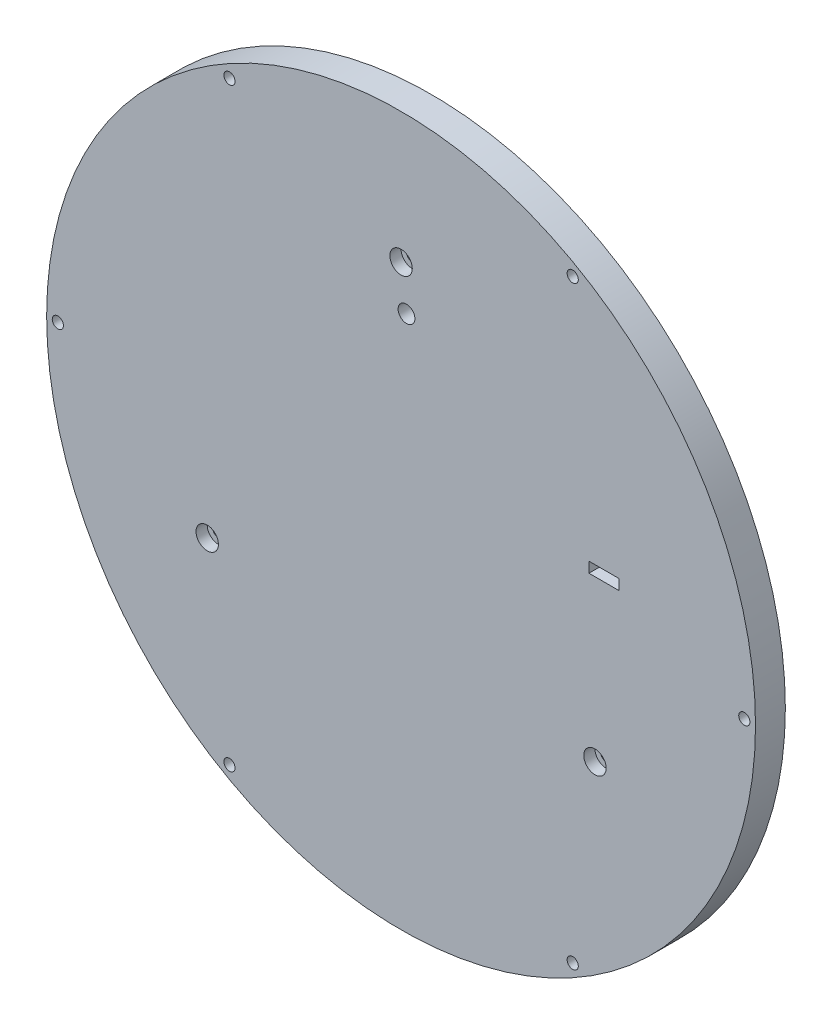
ISO-10303-21;
HEADER;
FILE_DESCRIPTION(('STEP AP214'),'2;1');
FILE_NAME('part.step','',(''),(''),'','','');
FILE_SCHEMA(('AUTOMOTIVE_DESIGN { 1 0 10303 214 1 1 1 1 }'));
ENDSEC;
DATA;
#1=APPLICATION_CONTEXT('core data for automotive mechanical design processes');
#2=APPLICATION_PROTOCOL_DEFINITION('international standard','automotive_design',2000,#1);
#3=PRODUCT_CONTEXT('',#1,'mechanical');
#4=PRODUCT('Part','Part','',(#3));
#5=PRODUCT_RELATED_PRODUCT_CATEGORY('part','',(#4));
#6=PRODUCT_DEFINITION_FORMATION('','',#4);
#7=PRODUCT_DEFINITION_CONTEXT('part definition',#1,'design');
#8=PRODUCT_DEFINITION('design','',#6,#7);
#9=PRODUCT_DEFINITION_SHAPE('','',#8);
#10=(LENGTH_UNIT() NAMED_UNIT(*) SI_UNIT(.MILLI.,.METRE.));
#11=(NAMED_UNIT(*) PLANE_ANGLE_UNIT() SI_UNIT($,.RADIAN.));
#12=(NAMED_UNIT(*) SI_UNIT($,.STERADIAN.) SOLID_ANGLE_UNIT());
#13=UNCERTAINTY_MEASURE_WITH_UNIT(LENGTH_MEASURE(1.E-05),#10,'distance_accuracy_value','');
#14=(GEOMETRIC_REPRESENTATION_CONTEXT(3) GLOBAL_UNCERTAINTY_ASSIGNED_CONTEXT((#13)) GLOBAL_UNIT_ASSIGNED_CONTEXT((#10,
#11,#12)) REPRESENTATION_CONTEXT('',''));
#15=CARTESIAN_POINT('',(0.,0.,0.));
#16=DIRECTION('',(0.,0.,1.));
#17=DIRECTION('',(1.,0.,0.));
#18=AXIS2_PLACEMENT_3D('',#15,#16,#17);
#19=CARTESIAN_POINT('',(-51.9615242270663,-30.,-6.));
#20=DIRECTION('',(0.,0.,1.));
#21=DIRECTION('',(1.,0.,0.));
#22=AXIS2_PLACEMENT_3D('',#19,#20,#21);
#23=CYLINDRICAL_SURFACE('',#22,1.5);
#24=CARTESIAN_POINT('',(-51.9615242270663,-30.,-4.));
#25=DIRECTION('',(0.,0.,1.));
#26=DIRECTION('',(1.,0.,0.));
#27=AXIS2_PLACEMENT_3D('',#24,#25,#26);
#28=CIRCLE('',#27,1.5);
#29=CARTESIAN_POINT('',(-50.4615242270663,-30.,-4.));
#30=VERTEX_POINT('',#29);
#31=EDGE_CURVE('E97',#30,#30,#28,.T.);
#32=ORIENTED_EDGE('',*,*,#31,.F.);
#33=EDGE_LOOP('',(#32));
#34=FACE_BOUND('',#33,.T.);
#35=CARTESIAN_POINT('',(-51.9615242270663,-30.,1.));
#36=DIRECTION('',(0.,0.,1.));
#37=DIRECTION('',(1.,0.,0.));
#38=AXIS2_PLACEMENT_3D('',#35,#36,#37);
#39=CIRCLE('',#38,1.5);
#40=CARTESIAN_POINT('',(-50.4615242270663,-30.,1.));
#41=VERTEX_POINT('',#40);
#42=EDGE_CURVE('E89',#41,#41,#39,.F.);
#43=ORIENTED_EDGE('',*,*,#42,.F.);
#44=EDGE_LOOP('',(#43));
#45=FACE_BOUND('',#44,.T.);
#46=ADVANCED_FACE('F16',(#34,#45),#23,.F.);
#47=CARTESIAN_POINT('',(51.9615242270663,-30.,-6.));
#48=DIRECTION('',(0.,0.,1.));
#49=DIRECTION('',(1.,0.,0.));
#50=AXIS2_PLACEMENT_3D('',#47,#48,#49);
#51=CYLINDRICAL_SURFACE('',#50,1.5);
#52=CARTESIAN_POINT('',(51.9615242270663,-30.,-4.));
#53=DIRECTION('',(0.,0.,1.));
#54=DIRECTION('',(1.,0.,0.));
#55=AXIS2_PLACEMENT_3D('',#52,#53,#54);
#56=CIRCLE('',#55,1.5);
#57=CARTESIAN_POINT('',(53.4615242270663,-30.,-4.));
#58=VERTEX_POINT('',#57);
#59=EDGE_CURVE('E105',#58,#58,#56,.T.);
#60=ORIENTED_EDGE('',*,*,#59,.F.);
#61=EDGE_LOOP('',(#60));
#62=FACE_BOUND('',#61,.T.);
#63=CARTESIAN_POINT('',(51.9615242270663,-30.,1.));
#64=DIRECTION('',(0.,0.,1.));
#65=DIRECTION('',(1.,0.,0.));
#66=AXIS2_PLACEMENT_3D('',#63,#64,#65);
#67=CIRCLE('',#66,1.5);
#68=CARTESIAN_POINT('',(53.4615242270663,-30.,1.));
#69=VERTEX_POINT('',#68);
#70=EDGE_CURVE('E116',#69,#69,#67,.F.);
#71=ORIENTED_EDGE('',*,*,#70,.F.);
#72=EDGE_LOOP('',(#71));
#73=FACE_BOUND('',#72,.T.);
#74=ADVANCED_FACE('F224',(#62,#73),#51,.F.);
#75=CARTESIAN_POINT('',(0.,60.,-6.));
#76=DIRECTION('',(0.,0.,1.));
#77=DIRECTION('',(1.,0.,0.));
#78=AXIS2_PLACEMENT_3D('',#75,#76,#77);
#79=CYLINDRICAL_SURFACE('',#78,1.49999999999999);
#80=CARTESIAN_POINT('',(0.,60.,-4.));
#81=DIRECTION('',(0.,0.,1.));
#82=DIRECTION('',(1.,0.,0.));
#83=AXIS2_PLACEMENT_3D('',#80,#81,#82);
#84=CIRCLE('',#83,1.49999999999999);
#85=CARTESIAN_POINT('',(1.49999999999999,60.,-4.));
#86=VERTEX_POINT('',#85);
#87=EDGE_CURVE('E98',#86,#86,#84,.T.);
#88=ORIENTED_EDGE('',*,*,#87,.F.);
#89=EDGE_LOOP('',(#88));
#90=FACE_BOUND('',#89,.T.);
#91=CARTESIAN_POINT('',(0.,60.,1.));
#92=DIRECTION('',(0.,0.,1.));
#93=DIRECTION('',(1.,0.,0.));
#94=AXIS2_PLACEMENT_3D('',#91,#92,#93);
#95=CIRCLE('',#94,1.49999999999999);
#96=CARTESIAN_POINT('',(1.49999999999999,60.,1.));
#97=VERTEX_POINT('',#96);
#98=EDGE_CURVE('E114',#97,#97,#95,.F.);
#99=ORIENTED_EDGE('',*,*,#98,.F.);
#100=EDGE_LOOP('',(#99));
#101=FACE_BOUND('',#100,.T.);
#102=ADVANCED_FACE('F189',(#90,#101),#79,.F.);
#103=CARTESIAN_POINT('',(0.,0.,4.));
#104=DIRECTION('',(0.,0.,1.));
#105=DIRECTION('',(1.,0.,0.));
#106=AXIS2_PLACEMENT_3D('',#103,#104,#105);
#107=PLANE('',#106);
#108=CARTESIAN_POINT('',(46.,-79.6743371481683,4.));
#109=DIRECTION('',(0.,0.,1.));
#110=DIRECTION('',(1.,0.,0.));
#111=AXIS2_PLACEMENT_3D('',#108,#109,#110);
#112=CIRCLE('',#111,1.5);
#113=CARTESIAN_POINT('',(47.5,-79.6743371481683,4.));
#114=VERTEX_POINT('',#113);
#115=EDGE_CURVE('E138',#114,#114,#112,.T.);
#116=ORIENTED_EDGE('',*,*,#115,.F.);
#117=EDGE_LOOP('',(#116));
#118=FACE_BOUND('',#117,.T.);
#119=CARTESIAN_POINT('',(-46.,-79.6743371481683,4.));
#120=DIRECTION('',(0.,0.,1.));
#121=DIRECTION('',(1.,0.,0.));
#122=AXIS2_PLACEMENT_3D('',#119,#120,#121);
#123=CIRCLE('',#122,1.5);
#124=CARTESIAN_POINT('',(-44.5,-79.6743371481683,4.));
#125=VERTEX_POINT('',#124);
#126=EDGE_CURVE('E140',#125,#125,#123,.T.);
#127=ORIENTED_EDGE('',*,*,#126,.F.);
#128=EDGE_LOOP('',(#127));
#129=FACE_BOUND('',#128,.T.);
#130=CARTESIAN_POINT('',(-92.,0.,4.));
#131=DIRECTION('',(0.,0.,1.));
#132=DIRECTION('',(1.,0.,0.));
#133=AXIS2_PLACEMENT_3D('',#130,#131,#132);
#134=CIRCLE('',#133,1.5);
#135=CARTESIAN_POINT('',(-90.5,0.,4.));
#136=VERTEX_POINT('',#135);
#137=EDGE_CURVE('E133',#136,#136,#134,.T.);
#138=ORIENTED_EDGE('',*,*,#137,.F.);
#139=EDGE_LOOP('',(#138));
#140=FACE_BOUND('',#139,.T.);
#141=CARTESIAN_POINT('',(-46.,79.6743371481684,4.));
#142=DIRECTION('',(0.,0.,1.));
#143=DIRECTION('',(1.,0.,0.));
#144=AXIS2_PLACEMENT_3D('',#141,#142,#143);
#145=CIRCLE('',#144,1.5);
#146=CARTESIAN_POINT('',(-44.5,79.6743371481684,4.));
#147=VERTEX_POINT('',#146);
#148=EDGE_CURVE('E129',#147,#147,#145,.T.);
#149=ORIENTED_EDGE('',*,*,#148,.F.);
#150=EDGE_LOOP('',(#149));
#151=FACE_BOUND('',#150,.T.);
#152=CARTESIAN_POINT('',(46.,79.6743371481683,4.));
#153=DIRECTION('',(0.,0.,1.));
#154=DIRECTION('',(1.,0.,0.));
#155=AXIS2_PLACEMENT_3D('',#152,#153,#154);
#156=CIRCLE('',#155,1.5);
#157=CARTESIAN_POINT('',(47.5,79.6743371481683,4.));
#158=VERTEX_POINT('',#157);
#159=EDGE_CURVE('E130',#158,#158,#156,.T.);
#160=ORIENTED_EDGE('',*,*,#159,.F.);
#161=EDGE_LOOP('',(#160));
#162=FACE_BOUND('',#161,.T.);
#163=CARTESIAN_POINT('',(92.,0.,4.));
#164=DIRECTION('',(0.,0.,1.));
#165=DIRECTION('',(1.,0.,0.));
#166=AXIS2_PLACEMENT_3D('',#163,#164,#165);
#167=CIRCLE('',#166,1.5);
#168=CARTESIAN_POINT('',(93.5,0.,4.));
#169=VERTEX_POINT('',#168);
#170=EDGE_CURVE('E123',#169,#169,#167,.T.);
#171=ORIENTED_EDGE('',*,*,#170,.F.);
#172=EDGE_LOOP('',(#171));
#173=FACE_BOUND('',#172,.T.);
#174=CARTESIAN_POINT('',(0.,60.,4.));
#175=DIRECTION('',(0.,0.,1.));
#176=DIRECTION('',(1.,0.,0.));
#177=AXIS2_PLACEMENT_3D('',#174,#175,#176);
#178=CIRCLE('',#177,3.);
#179=CARTESIAN_POINT('',(3.,60.,4.));
#180=VERTEX_POINT('',#179);
#181=EDGE_CURVE('E165',#180,#180,#178,.T.);
#182=ORIENTED_EDGE('',*,*,#181,.F.);
#183=EDGE_LOOP('',(#182));
#184=FACE_BOUND('',#183,.T.);
#185=CARTESIAN_POINT('',(51.9615242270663,-30.,4.));
#186=DIRECTION('',(0.,0.,1.));
#187=DIRECTION('',(1.,0.,0.));
#188=AXIS2_PLACEMENT_3D('',#185,#186,#187);
#189=CIRCLE('',#188,3.);
#190=CARTESIAN_POINT('',(54.9615242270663,-30.,4.));
#191=VERTEX_POINT('',#190);
#192=EDGE_CURVE('E164',#191,#191,#189,.T.);
#193=ORIENTED_EDGE('',*,*,#192,.F.);
#194=EDGE_LOOP('',(#193));
#195=FACE_BOUND('',#194,.T.);
#196=CARTESIAN_POINT('',(-51.9615242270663,-30.,4.));
#197=DIRECTION('',(0.,0.,1.));
#198=DIRECTION('',(1.,0.,0.));
#199=AXIS2_PLACEMENT_3D('',#196,#197,#198);
#200=CIRCLE('',#199,3.);
#201=CARTESIAN_POINT('',(-48.9615242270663,-30.,4.));
#202=VERTEX_POINT('',#201);
#203=EDGE_CURVE('E171',#202,#202,#200,.T.);
#204=ORIENTED_EDGE('',*,*,#203,.F.);
#205=EDGE_LOOP('',(#204));
#206=FACE_BOUND('',#205,.T.);
#207=CARTESIAN_POINT('',(0.,0.,4.));
#208=DIRECTION('',(0.,0.,1.));
#209=DIRECTION('',(1.,0.,0.));
#210=AXIS2_PLACEMENT_3D('',#207,#208,#209);
#211=CIRCLE('',#210,95.);
#212=CARTESIAN_POINT('',(95.,0.,4.));
#213=VERTEX_POINT('',#212);
#214=EDGE_CURVE('E93',#213,#213,#211,.T.);
#215=ORIENTED_EDGE('',*,*,#214,.T.);
#216=EDGE_LOOP('',(#215));
#217=FACE_BOUND('',#216,.T.);
#218=CARTESIAN_POINT('',(1.45512772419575,48.7281808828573,4.));
#219=DIRECTION('',(0.,0.,1.));
#220=DIRECTION('',(1.,0.,0.));
#221=AXIS2_PLACEMENT_3D('',#218,#219,#220);
#222=CIRCLE('',#221,2.25);
#223=CARTESIAN_POINT('',(3.70512772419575,48.7281808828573,4.));
#224=VERTEX_POINT('',#223);
#225=EDGE_CURVE('E87',#224,#224,#222,.T.);
#226=ORIENTED_EDGE('',*,*,#225,.F.);
#227=EDGE_LOOP('',(#226));
#228=FACE_BOUND('',#227,.T.);
#229=DIRECTION('',(0.,1.,0.));
#230=VECTOR('',#229,1.);
#231=CARTESIAN_POINT('',(58.3547723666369,15.7660744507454,4.));
#232=LINE('',#231,#230);
#233=CARTESIAN_POINT('',(58.3547723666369,12.9660744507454,4.));
#234=VERTEX_POINT('',#233);
#235=CARTESIAN_POINT('',(58.3547723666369,15.7660744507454,4.));
#236=VERTEX_POINT('',#235);
#237=EDGE_CURVE('E31',#234,#236,#232,.T.);
#238=ORIENTED_EDGE('',*,*,#237,.F.);
#239=DIRECTION('',(1.,0.,0.));
#240=VECTOR('',#239,1.);
#241=CARTESIAN_POINT('',(50.3547723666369,12.9660744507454,4.));
#242=LINE('',#241,#240);
#243=CARTESIAN_POINT('',(50.3547723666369,12.9660744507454,4.));
#244=VERTEX_POINT('',#243);
#245=EDGE_CURVE('E80',#244,#234,#242,.T.);
#246=ORIENTED_EDGE('',*,*,#245,.F.);
#247=DIRECTION('',(0.,-1.,0.));
#248=VECTOR('',#247,1.);
#249=CARTESIAN_POINT('',(50.3547723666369,15.7660744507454,4.));
#250=LINE('',#249,#248);
#251=CARTESIAN_POINT('',(50.3547723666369,15.7660744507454,4.));
#252=VERTEX_POINT('',#251);
#253=EDGE_CURVE('E62',#252,#244,#250,.T.);
#254=ORIENTED_EDGE('',*,*,#253,.F.);
#255=DIRECTION('',(-1.,0.,0.));
#256=VECTOR('',#255,1.);
#257=CARTESIAN_POINT('',(50.3547723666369,15.7660744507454,4.));
#258=LINE('',#257,#256);
#259=EDGE_CURVE('E75',#236,#252,#258,.T.);
#260=ORIENTED_EDGE('',*,*,#259,.F.);
#261=EDGE_LOOP('',(#238,#246,#254,#260));
#262=FACE_BOUND('',#261,.T.);
#263=ADVANCED_FACE('F74',(#118,#129,#140,#151,#162,#173,#184,#195,#206,#217,#228,#262),#107,.T.);
#264=CARTESIAN_POINT('',(0.,0.,-4.));
#265=DIRECTION('',(0.,0.,1.));
#266=DIRECTION('',(1.,0.,0.));
#267=AXIS2_PLACEMENT_3D('',#264,#265,#266);
#268=PLANE('',#267);
#269=CARTESIAN_POINT('',(46.,-79.6743371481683,-4.));
#270=DIRECTION('',(0.,0.,1.));
#271=DIRECTION('',(1.,0.,0.));
#272=AXIS2_PLACEMENT_3D('',#269,#270,#271);
#273=CIRCLE('',#272,1.5);
#274=CARTESIAN_POINT('',(47.5,-79.6743371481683,-4.));
#275=VERTEX_POINT('',#274);
#276=EDGE_CURVE('E20',#275,#275,#273,.T.);
#277=ORIENTED_EDGE('',*,*,#276,.T.);
#278=EDGE_LOOP('',(#277));
#279=FACE_BOUND('',#278,.T.);
#280=CARTESIAN_POINT('',(-46.,-79.6743371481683,-4.));
#281=DIRECTION('',(0.,0.,1.));
#282=DIRECTION('',(1.,0.,0.));
#283=AXIS2_PLACEMENT_3D('',#280,#281,#282);
#284=CIRCLE('',#283,1.5);
#285=CARTESIAN_POINT('',(-44.5,-79.6743371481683,-4.));
#286=VERTEX_POINT('',#285);
#287=EDGE_CURVE('E139',#286,#286,#284,.T.);
#288=ORIENTED_EDGE('',*,*,#287,.T.);
#289=EDGE_LOOP('',(#288));
#290=FACE_BOUND('',#289,.T.);
#291=CARTESIAN_POINT('',(-92.,0.,-4.));
#292=DIRECTION('',(0.,0.,1.));
#293=DIRECTION('',(1.,0.,0.));
#294=AXIS2_PLACEMENT_3D('',#291,#292,#293);
#295=CIRCLE('',#294,1.5);
#296=CARTESIAN_POINT('',(-90.5,0.,-4.));
#297=VERTEX_POINT('',#296);
#298=EDGE_CURVE('E134',#297,#297,#295,.T.);
#299=ORIENTED_EDGE('',*,*,#298,.T.);
#300=EDGE_LOOP('',(#299));
#301=FACE_BOUND('',#300,.T.);
#302=CARTESIAN_POINT('',(-46.,79.6743371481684,-4.));
#303=DIRECTION('',(0.,0.,1.));
#304=DIRECTION('',(1.,0.,0.));
#305=AXIS2_PLACEMENT_3D('',#302,#303,#304);
#306=CIRCLE('',#305,1.5);
#307=CARTESIAN_POINT('',(-44.5,79.6743371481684,-4.));
#308=VERTEX_POINT('',#307);
#309=EDGE_CURVE('E131',#308,#308,#306,.T.);
#310=ORIENTED_EDGE('',*,*,#309,.T.);
#311=EDGE_LOOP('',(#310));
#312=FACE_BOUND('',#311,.T.);
#313=CARTESIAN_POINT('',(46.,79.6743371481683,-4.));
#314=DIRECTION('',(0.,0.,1.));
#315=DIRECTION('',(1.,0.,0.));
#316=AXIS2_PLACEMENT_3D('',#313,#314,#315);
#317=CIRCLE('',#316,1.5);
#318=CARTESIAN_POINT('',(47.5,79.6743371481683,-4.));
#319=VERTEX_POINT('',#318);
#320=EDGE_CURVE('E126',#319,#319,#317,.T.);
#321=ORIENTED_EDGE('',*,*,#320,.T.);
#322=EDGE_LOOP('',(#321));
#323=FACE_BOUND('',#322,.T.);
#324=CARTESIAN_POINT('',(92.,0.,-4.));
#325=DIRECTION('',(0.,0.,1.));
#326=DIRECTION('',(1.,0.,0.));
#327=AXIS2_PLACEMENT_3D('',#324,#325,#326);
#328=CIRCLE('',#327,1.5);
#329=CARTESIAN_POINT('',(93.5,0.,-4.));
#330=VERTEX_POINT('',#329);
#331=EDGE_CURVE('E125',#330,#330,#328,.T.);
#332=ORIENTED_EDGE('',*,*,#331,.T.);
#333=EDGE_LOOP('',(#332));
#334=FACE_BOUND('',#333,.T.);
#335=DIRECTION('',(1.,0.,0.));
#336=VECTOR('',#335,1.);
#337=CARTESIAN_POINT('',(0.,12.9660744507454,-4.));
#338=LINE('',#337,#336);
#339=CARTESIAN_POINT('',(50.3547723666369,12.9660744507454,-4.));
#340=VERTEX_POINT('',#339);
#341=CARTESIAN_POINT('',(58.3547723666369,12.9660744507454,-4.));
#342=VERTEX_POINT('',#341);
#343=EDGE_CURVE('E25',#340,#342,#338,.T.);
#344=ORIENTED_EDGE('',*,*,#343,.T.);
#345=DIRECTION('',(0.,1.,0.));
#346=VECTOR('',#345,1.);
#347=CARTESIAN_POINT('',(58.3547723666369,0.,-4.));
#348=LINE('',#347,#346);
#349=CARTESIAN_POINT('',(58.3547723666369,15.7660744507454,-4.));
#350=VERTEX_POINT('',#349);
#351=EDGE_CURVE('E10',#342,#350,#348,.T.);
#352=ORIENTED_EDGE('',*,*,#351,.T.);
#353=DIRECTION('',(-1.,0.,0.));
#354=VECTOR('',#353,1.);
#355=CARTESIAN_POINT('',(0.,15.7660744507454,-4.));
#356=LINE('',#355,#354);
#357=CARTESIAN_POINT('',(50.3547723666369,15.7660744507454,-4.));
#358=VERTEX_POINT('',#357);
#359=EDGE_CURVE('E94',#350,#358,#356,.T.);
#360=ORIENTED_EDGE('',*,*,#359,.T.);
#361=DIRECTION('',(0.,-1.,0.));
#362=VECTOR('',#361,1.);
#363=CARTESIAN_POINT('',(50.3547723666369,0.,-4.));
#364=LINE('',#363,#362);
#365=EDGE_CURVE('E65',#358,#340,#364,.T.);
#366=ORIENTED_EDGE('',*,*,#365,.T.);
#367=EDGE_LOOP('',(#344,#352,#360,#366));
#368=FACE_BOUND('',#367,.T.);
#369=CARTESIAN_POINT('',(1.45512772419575,48.7281808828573,-4.));
#370=DIRECTION('',(0.,0.,1.));
#371=DIRECTION('',(1.,0.,0.));
#372=AXIS2_PLACEMENT_3D('',#369,#370,#371);
#373=CIRCLE('',#372,2.25);
#374=CARTESIAN_POINT('',(3.70512772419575,48.7281808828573,-4.));
#375=VERTEX_POINT('',#374);
#376=EDGE_CURVE('E81',#375,#375,#373,.T.);
#377=ORIENTED_EDGE('',*,*,#376,.T.);
#378=EDGE_LOOP('',(#377));
#379=FACE_BOUND('',#378,.T.);
#380=ORIENTED_EDGE('',*,*,#87,.T.);
#381=EDGE_LOOP('',(#380));
#382=FACE_BOUND('',#381,.T.);
#383=ORIENTED_EDGE('',*,*,#59,.T.);
#384=EDGE_LOOP('',(#383));
#385=FACE_BOUND('',#384,.T.);
#386=ORIENTED_EDGE('',*,*,#31,.T.);
#387=EDGE_LOOP('',(#386));
#388=FACE_BOUND('',#387,.T.);
#389=CARTESIAN_POINT('',(0.,0.,-4.));
#390=DIRECTION('',(0.,0.,1.));
#391=DIRECTION('',(1.,0.,0.));
#392=AXIS2_PLACEMENT_3D('',#389,#390,#391);
#393=CIRCLE('',#392,95.);
#394=CARTESIAN_POINT('',(95.,0.,-4.));
#395=VERTEX_POINT('',#394);
#396=EDGE_CURVE('E92',#395,#395,#393,.T.);
#397=ORIENTED_EDGE('',*,*,#396,.F.);
#398=EDGE_LOOP('',(#397));
#399=FACE_BOUND('',#398,.T.);
#400=ADVANCED_FACE('F188',(#279,#290,#301,#312,#323,#334,#368,#379,#382,#385,#388,#399),#268,.F.);
#401=CARTESIAN_POINT('',(0.,0.,4.));
#402=DIRECTION('',(0.,0.,-1.));
#403=DIRECTION('',(-1.,0.,0.));
#404=AXIS2_PLACEMENT_3D('',#401,#402,#403);
#405=CYLINDRICAL_SURFACE('',#404,95.);
#406=ORIENTED_EDGE('',*,*,#214,.F.);
#407=EDGE_LOOP('',(#406));
#408=FACE_BOUND('',#407,.T.);
#409=ORIENTED_EDGE('',*,*,#396,.T.);
#410=EDGE_LOOP('',(#409));
#411=FACE_BOUND('',#410,.T.);
#412=ADVANCED_FACE('F18',(#408,#411),#405,.T.);
#413=CARTESIAN_POINT('',(1.45512772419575,48.7281808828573,-6.));
#414=DIRECTION('',(0.,0.,1.));
#415=DIRECTION('',(1.,0.,0.));
#416=AXIS2_PLACEMENT_3D('',#413,#414,#415);
#417=CYLINDRICAL_SURFACE('',#416,2.25);
#418=ORIENTED_EDGE('',*,*,#225,.T.);
#419=EDGE_LOOP('',(#418));
#420=FACE_BOUND('',#419,.T.);
#421=ORIENTED_EDGE('',*,*,#376,.F.);
#422=EDGE_LOOP('',(#421));
#423=FACE_BOUND('',#422,.T.);
#424=ADVANCED_FACE('F197',(#420,#423),#417,.F.);
#425=CARTESIAN_POINT('',(58.3547723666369,15.7660744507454,-6.));
#426=DIRECTION('',(1.,0.,0.));
#427=DIRECTION('',(0.,0.,-1.));
#428=AXIS2_PLACEMENT_3D('',#425,#426,#427);
#429=PLANE('',#428);
#430=DIRECTION('',(0.,0.,1.));
#431=VECTOR('',#430,1.);
#432=CARTESIAN_POINT('',(58.3547723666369,12.9660744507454,-6.));
#433=LINE('',#432,#431);
#434=EDGE_CURVE('E85',#342,#234,#433,.T.);
#435=ORIENTED_EDGE('',*,*,#434,.T.);
#436=ORIENTED_EDGE('',*,*,#237,.T.);
#437=DIRECTION('',(0.,0.,1.));
#438=VECTOR('',#437,1.);
#439=CARTESIAN_POINT('',(58.3547723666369,15.7660744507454,-6.));
#440=LINE('',#439,#438);
#441=EDGE_CURVE('E69',#350,#236,#440,.T.);
#442=ORIENTED_EDGE('',*,*,#441,.F.);
#443=ORIENTED_EDGE('',*,*,#351,.F.);
#444=EDGE_LOOP('',(#435,#436,#442,#443));
#445=FACE_BOUND('',#444,.T.);
#446=ADVANCED_FACE('F199',(#445),#429,.F.);
#447=CARTESIAN_POINT('',(50.3547723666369,12.9660744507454,-6.));
#448=DIRECTION('',(0.,-1.,0.));
#449=DIRECTION('',(0.,0.,-1.));
#450=AXIS2_PLACEMENT_3D('',#447,#448,#449);
#451=PLANE('',#450);
#452=DIRECTION('',(0.,0.,1.));
#453=VECTOR('',#452,1.);
#454=CARTESIAN_POINT('',(50.3547723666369,12.9660744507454,-6.));
#455=LINE('',#454,#453);
#456=EDGE_CURVE('E70',#340,#244,#455,.T.);
#457=ORIENTED_EDGE('',*,*,#456,.T.);
#458=ORIENTED_EDGE('',*,*,#245,.T.);
#459=ORIENTED_EDGE('',*,*,#434,.F.);
#460=ORIENTED_EDGE('',*,*,#343,.F.);
#461=EDGE_LOOP('',(#457,#458,#459,#460));
#462=FACE_BOUND('',#461,.T.);
#463=ADVANCED_FACE('F237',(#462),#451,.F.);
#464=CARTESIAN_POINT('',(50.3547723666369,15.7660744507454,-6.));
#465=DIRECTION('',(-1.,0.,0.));
#466=DIRECTION('',(0.,0.,1.));
#467=AXIS2_PLACEMENT_3D('',#464,#465,#466);
#468=PLANE('',#467);
#469=DIRECTION('',(0.,0.,1.));
#470=VECTOR('',#469,1.);
#471=CARTESIAN_POINT('',(50.3547723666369,15.7660744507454,-6.));
#472=LINE('',#471,#470);
#473=EDGE_CURVE('E41',#358,#252,#472,.T.);
#474=ORIENTED_EDGE('',*,*,#473,.T.);
#475=ORIENTED_EDGE('',*,*,#253,.T.);
#476=ORIENTED_EDGE('',*,*,#456,.F.);
#477=ORIENTED_EDGE('',*,*,#365,.F.);
#478=EDGE_LOOP('',(#474,#475,#476,#477));
#479=FACE_BOUND('',#478,.T.);
#480=ADVANCED_FACE('F56',(#479),#468,.F.);
#481=CARTESIAN_POINT('',(50.3547723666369,15.7660744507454,-6.));
#482=DIRECTION('',(0.,1.,0.));
#483=DIRECTION('',(0.,0.,1.));
#484=AXIS2_PLACEMENT_3D('',#481,#482,#483);
#485=PLANE('',#484);
#486=ORIENTED_EDGE('',*,*,#441,.T.);
#487=ORIENTED_EDGE('',*,*,#259,.T.);
#488=ORIENTED_EDGE('',*,*,#473,.F.);
#489=ORIENTED_EDGE('',*,*,#359,.F.);
#490=EDGE_LOOP('',(#486,#487,#488,#489));
#491=FACE_BOUND('',#490,.T.);
#492=ADVANCED_FACE('F71',(#491),#485,.F.);
#493=CARTESIAN_POINT('',(0.,60.,1.));
#494=DIRECTION('',(0.,0.,1.));
#495=DIRECTION('',(1.,0.,0.));
#496=AXIS2_PLACEMENT_3D('',#493,#494,#495);
#497=PLANE('',#496);
#498=CARTESIAN_POINT('',(0.,60.,1.));
#499=DIRECTION('',(0.,0.,1.));
#500=DIRECTION('',(1.,0.,0.));
#501=AXIS2_PLACEMENT_3D('',#498,#499,#500);
#502=CIRCLE('',#501,3.);
#503=CARTESIAN_POINT('',(3.,60.,1.));
#504=VERTEX_POINT('',#503);
#505=EDGE_CURVE('E117',#504,#504,#502,.T.);
#506=ORIENTED_EDGE('',*,*,#505,.T.);
#507=EDGE_LOOP('',(#506));
#508=FACE_BOUND('',#507,.T.);
#509=ORIENTED_EDGE('',*,*,#98,.T.);
#510=EDGE_LOOP('',(#509));
#511=FACE_BOUND('',#510,.T.);
#512=ADVANCED_FACE('F245',(#508,#511),#497,.T.);
#513=CARTESIAN_POINT('',(0.,60.,1.));
#514=DIRECTION('',(0.,0.,1.));
#515=DIRECTION('',(1.,0.,0.));
#516=AXIS2_PLACEMENT_3D('',#513,#514,#515);
#517=CYLINDRICAL_SURFACE('',#516,3.);
#518=ORIENTED_EDGE('',*,*,#505,.F.);
#519=EDGE_LOOP('',(#518));
#520=FACE_BOUND('',#519,.T.);
#521=ORIENTED_EDGE('',*,*,#181,.T.);
#522=EDGE_LOOP('',(#521));
#523=FACE_BOUND('',#522,.T.);
#524=ADVANCED_FACE('F255',(#520,#523),#517,.F.);
#525=CARTESIAN_POINT('',(51.9615242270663,-30.,1.));
#526=DIRECTION('',(0.,0.,1.));
#527=DIRECTION('',(1.,0.,0.));
#528=AXIS2_PLACEMENT_3D('',#525,#526,#527);
#529=PLANE('',#528);
#530=CARTESIAN_POINT('',(51.9615242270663,-30.,1.));
#531=DIRECTION('',(0.,0.,1.));
#532=DIRECTION('',(1.,0.,0.));
#533=AXIS2_PLACEMENT_3D('',#530,#531,#532);
#534=CIRCLE('',#533,3.);
#535=CARTESIAN_POINT('',(54.9615242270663,-30.,1.));
#536=VERTEX_POINT('',#535);
#537=EDGE_CURVE('E169',#536,#536,#534,.T.);
#538=ORIENTED_EDGE('',*,*,#537,.T.);
#539=EDGE_LOOP('',(#538));
#540=FACE_BOUND('',#539,.T.);
#541=ORIENTED_EDGE('',*,*,#70,.T.);
#542=EDGE_LOOP('',(#541));
#543=FACE_BOUND('',#542,.T.);
#544=ADVANCED_FACE('F253',(#540,#543),#529,.T.);
#545=CARTESIAN_POINT('',(51.9615242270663,-30.,1.));
#546=DIRECTION('',(0.,0.,1.));
#547=DIRECTION('',(1.,0.,0.));
#548=AXIS2_PLACEMENT_3D('',#545,#546,#547);
#549=CYLINDRICAL_SURFACE('',#548,3.);
#550=ORIENTED_EDGE('',*,*,#537,.F.);
#551=EDGE_LOOP('',(#550));
#552=FACE_BOUND('',#551,.T.);
#553=ORIENTED_EDGE('',*,*,#192,.T.);
#554=EDGE_LOOP('',(#553));
#555=FACE_BOUND('',#554,.T.);
#556=ADVANCED_FACE('F246',(#552,#555),#549,.F.);
#557=CARTESIAN_POINT('',(-51.9615242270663,-30.,1.));
#558=DIRECTION('',(0.,0.,1.));
#559=DIRECTION('',(1.,0.,0.));
#560=AXIS2_PLACEMENT_3D('',#557,#558,#559);
#561=PLANE('',#560);
#562=CARTESIAN_POINT('',(-51.9615242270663,-30.,1.));
#563=DIRECTION('',(0.,0.,1.));
#564=DIRECTION('',(1.,0.,0.));
#565=AXIS2_PLACEMENT_3D('',#562,#563,#564);
#566=CIRCLE('',#565,3.);
#567=CARTESIAN_POINT('',(-48.9615242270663,-30.,1.));
#568=VERTEX_POINT('',#567);
#569=EDGE_CURVE('E157',#568,#568,#566,.T.);
#570=ORIENTED_EDGE('',*,*,#569,.T.);
#571=EDGE_LOOP('',(#570));
#572=FACE_BOUND('',#571,.T.);
#573=ORIENTED_EDGE('',*,*,#42,.T.);
#574=EDGE_LOOP('',(#573));
#575=FACE_BOUND('',#574,.T.);
#576=ADVANCED_FACE('F180',(#572,#575),#561,.T.);
#577=CARTESIAN_POINT('',(-51.9615242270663,-30.,1.));
#578=DIRECTION('',(0.,0.,1.));
#579=DIRECTION('',(1.,0.,0.));
#580=AXIS2_PLACEMENT_3D('',#577,#578,#579);
#581=CYLINDRICAL_SURFACE('',#580,3.);
#582=ORIENTED_EDGE('',*,*,#569,.F.);
#583=EDGE_LOOP('',(#582));
#584=FACE_BOUND('',#583,.T.);
#585=ORIENTED_EDGE('',*,*,#203,.T.);
#586=EDGE_LOOP('',(#585));
#587=FACE_BOUND('',#586,.T.);
#588=ADVANCED_FACE('F178',(#584,#587),#581,.F.);
#589=CARTESIAN_POINT('',(92.,0.,-4.15));
#590=DIRECTION('',(0.,0.,1.));
#591=DIRECTION('',(1.,0.,0.));
#592=AXIS2_PLACEMENT_3D('',#589,#590,#591);
#593=CYLINDRICAL_SURFACE('',#592,1.5);
#594=ORIENTED_EDGE('',*,*,#170,.T.);
#595=EDGE_LOOP('',(#594));
#596=FACE_BOUND('',#595,.T.);
#597=ORIENTED_EDGE('',*,*,#331,.F.);
#598=EDGE_LOOP('',(#597));
#599=FACE_BOUND('',#598,.T.);
#600=ADVANCED_FACE('F183',(#596,#599),#593,.F.);
#601=CARTESIAN_POINT('',(46.,79.6743371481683,-4.15));
#602=DIRECTION('',(0.,0.,1.));
#603=DIRECTION('',(1.,0.,0.));
#604=AXIS2_PLACEMENT_3D('',#601,#602,#603);
#605=CYLINDRICAL_SURFACE('',#604,1.5);
#606=ORIENTED_EDGE('',*,*,#159,.T.);
#607=EDGE_LOOP('',(#606));
#608=FACE_BOUND('',#607,.T.);
#609=ORIENTED_EDGE('',*,*,#320,.F.);
#610=EDGE_LOOP('',(#609));
#611=FACE_BOUND('',#610,.T.);
#612=ADVANCED_FACE('F270',(#608,#611),#605,.F.);
#613=CARTESIAN_POINT('',(-46.,79.6743371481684,-4.15));
#614=DIRECTION('',(0.,0.,1.));
#615=DIRECTION('',(1.,0.,0.));
#616=AXIS2_PLACEMENT_3D('',#613,#614,#615);
#617=CYLINDRICAL_SURFACE('',#616,1.5);
#618=ORIENTED_EDGE('',*,*,#148,.T.);
#619=EDGE_LOOP('',(#618));
#620=FACE_BOUND('',#619,.T.);
#621=ORIENTED_EDGE('',*,*,#309,.F.);
#622=EDGE_LOOP('',(#621));
#623=FACE_BOUND('',#622,.T.);
#624=ADVANCED_FACE('F271',(#620,#623),#617,.F.);
#625=CARTESIAN_POINT('',(-92.,0.,-4.15));
#626=DIRECTION('',(0.,0.,1.));
#627=DIRECTION('',(1.,0.,0.));
#628=AXIS2_PLACEMENT_3D('',#625,#626,#627);
#629=CYLINDRICAL_SURFACE('',#628,1.5);
#630=ORIENTED_EDGE('',*,*,#137,.T.);
#631=EDGE_LOOP('',(#630));
#632=FACE_BOUND('',#631,.T.);
#633=ORIENTED_EDGE('',*,*,#298,.F.);
#634=EDGE_LOOP('',(#633));
#635=FACE_BOUND('',#634,.T.);
#636=ADVANCED_FACE('F274',(#632,#635),#629,.F.);
#637=CARTESIAN_POINT('',(-46.,-79.6743371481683,-4.15));
#638=DIRECTION('',(0.,0.,1.));
#639=DIRECTION('',(1.,0.,0.));
#640=AXIS2_PLACEMENT_3D('',#637,#638,#639);
#641=CYLINDRICAL_SURFACE('',#640,1.5);
#642=ORIENTED_EDGE('',*,*,#126,.T.);
#643=EDGE_LOOP('',(#642));
#644=FACE_BOUND('',#643,.T.);
#645=ORIENTED_EDGE('',*,*,#287,.F.);
#646=EDGE_LOOP('',(#645));
#647=FACE_BOUND('',#646,.T.);
#648=ADVANCED_FACE('F276',(#644,#647),#641,.F.);
#649=CARTESIAN_POINT('',(46.,-79.6743371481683,-4.15));
#650=DIRECTION('',(0.,0.,1.));
#651=DIRECTION('',(1.,0.,0.));
#652=AXIS2_PLACEMENT_3D('',#649,#650,#651);
#653=CYLINDRICAL_SURFACE('',#652,1.5);
#654=ORIENTED_EDGE('',*,*,#115,.T.);
#655=EDGE_LOOP('',(#654));
#656=FACE_BOUND('',#655,.T.);
#657=ORIENTED_EDGE('',*,*,#276,.F.);
#658=EDGE_LOOP('',(#657));
#659=FACE_BOUND('',#658,.T.);
#660=ADVANCED_FACE('F284',(#656,#659),#653,.F.);
#661=CLOSED_SHELL('',(#46,#74,#102,#263,#400,#412,#424,#446,#463,#480,#492,#512,#524,#544,#556,
#576,#588,#600,#612,#624,#636,#648,#660));
#662=MANIFOLD_SOLID_BREP('B1',#661);
#663=ADVANCED_BREP_SHAPE_REPRESENTATION('',(#18,#662),#14);
#664=SHAPE_DEFINITION_REPRESENTATION(#9,#663);
ENDSEC;
END-ISO-10303-21;
